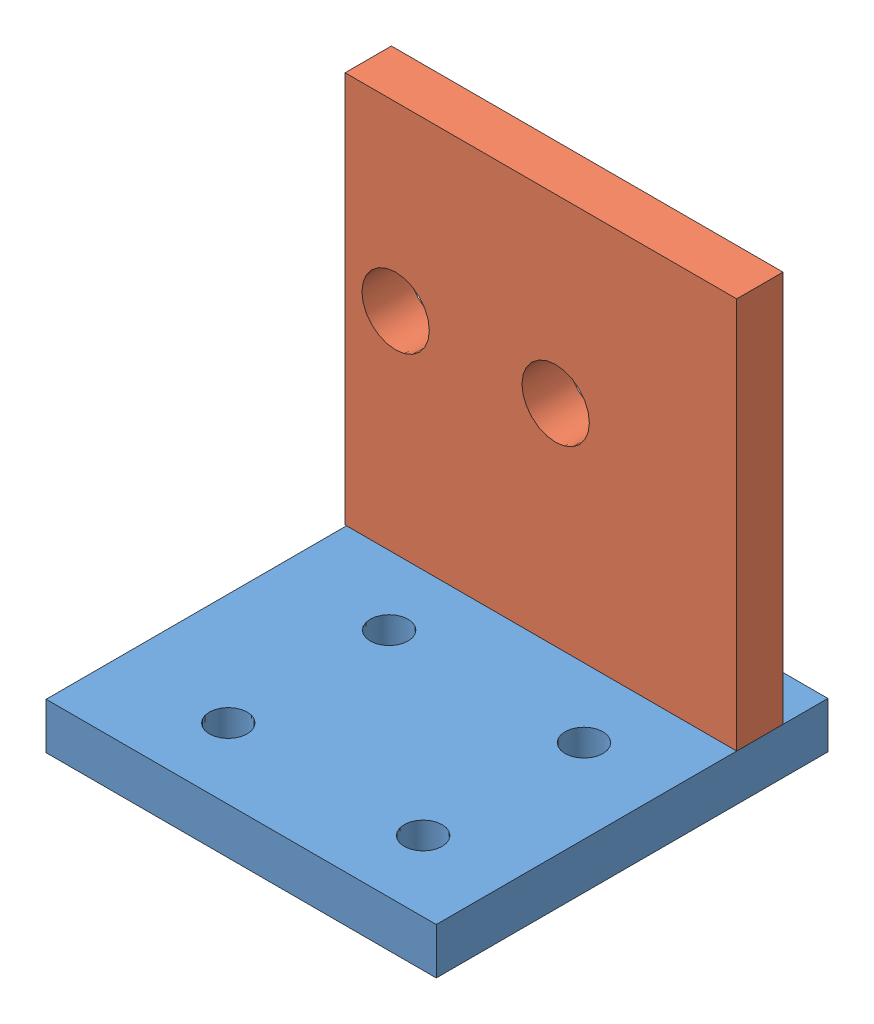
SolidWorks assembly Assem2.sldasm, configuration Default (file format 11000). Lengths in mm.
Overall size (46.5 52 46.5).
2 component instances, 2 part files, 3 mates.
Components (placement in the parent):
- stepper_holder2-2: stepper_holder2.SLDPRT [Default] at (28.3335 -3.9562 46.5) size (46.33 5.5 46.5)
- stepper_end-2: stepper_end.SLDPRT [Default] at (28.3335 48.0438 3.5) x (1 0 0) z (0 0 -1) size (46.5 52 5.5)
Mates (geometry in assembly coordinates):
- Coincident4: coincident: plane of stepper_holder2-2 through (28.3335 -3.9562 46.5) normal (0 -1 0); plane of stepper_end-2 through (1.4585 -3.9562 -2) normal (0 -1 0)
- Coincident5: coincident: line of stepper_holder2-2 through (22.9585 -3.9562 -2) axis (-1 0 0); line of stepper_end-2 through (22.9585 -3.9562 -2) axis (-1 0 0)
- Coincident6: coincident: line of stepper_holder2-2 through (-9.2915 -3.9562 -2) axis (0 0 1); line of stepper_end-2 through (-9.2915 -3.9562 -2) axis (0 0 1)
